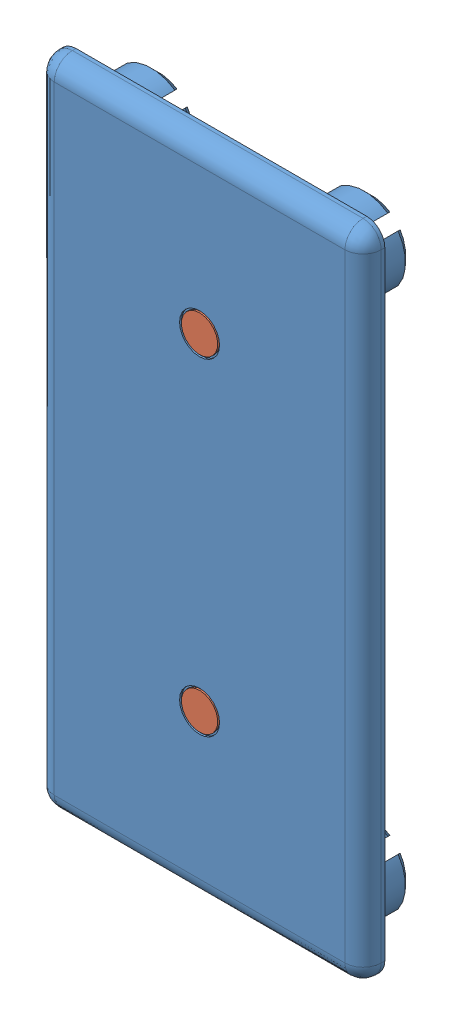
SolidWorks assembly 22.1007_1 END CAP 45X90 GRAY.SLDASM, configuration Default (file format 3800). Lengths in mm.
Overall size (45 90 11.9).
3 component instances, 2 part files, 4 mates.
Components (placement in the parent):
- 22.1007_1 End Cap 45x90 Gray-1: 22.1007_1 End Cap 45x90 Gray.SLDPRT [Default] at origin size (45 90 9)
- END CAP DOWEL GRAY-1: END CAP DOWEL GRAY.SLDPRT [Default] at (206.1493 78.1161 -7) x (-0.923728 -0.383049 0) z (0 0 -1) size (5 5 11.9)
- END CAP DOWEL GRAY-2: END CAP DOWEL GRAY.SLDPRT [Default] at (206.1493 33.1161 -7) x (-0.923728 -0.383049 0) z (0 0 -1) size (5 5 11.9)
Mates (geometry in assembly coordinates):
- Coincident1: coincident: plane of 22.1007_1 End Cap 45x90 Gray-1 through (-32.7349 63.4396 6) normal (0 0 1); plane of ? through (10.7038 -44.2268 6) normal (0 0 1)
- Coincident2: coincident: plane of ? through (23.586 -31.1706 6) normal (0 0 1); plane of 22.1007_1 End Cap 45x90 Gray-1 through (-32.7349 63.4396 6) normal (0 0 1)
- Coincident3: coincident aligned: axis of 22.1007_1 End Cap 45x90 Gray-1; axis of ?
- Coincident4: coincident aligned: axis of 22.1007_1 End Cap 45x90 Gray-1; axis of ?
